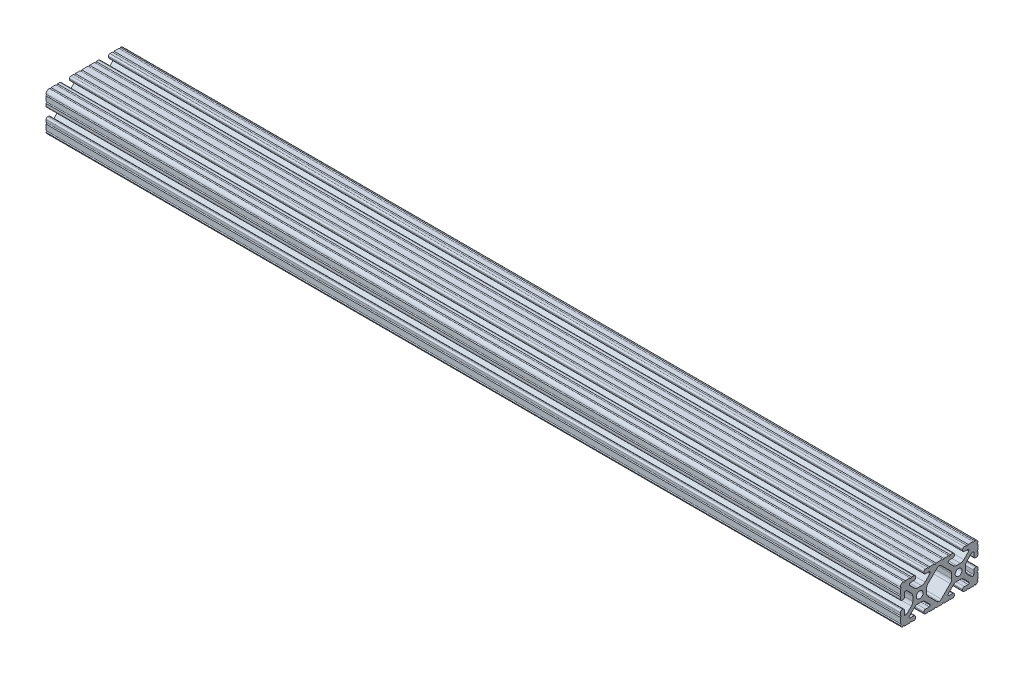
from build123d import *

# Parameters (mm, degrees)
SKETCH1_R      = 3.3274
EXTRUDE1_DEPTH = 838.2
SKETCH3_R      = 3.571875
EXTRUDE2_DEPTH = 38.1


with BuildPart() as part:
    # Sketch1 → Extrude1 (new body)
    with BuildSketch(Plane(origin=(0, 0, 0), x_dir=(0, 0, -1), z_dir=(1, 0, 0))):
        with BuildLine():
            Line((37.1900335, 54.320138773), (37.1900335, 54.882716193))
            ThreePointArc((37.1900335, 54.882716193), (37.450415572, 55.511334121), (38.0790335, 55.771716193))
            Line((38.0790335, 55.771716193), (41.685477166, 55.771716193))
            ThreePointArc((41.685477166, 55.771716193), (42.799028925, 56.232964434), (43.260277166, 57.346516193))
            Line((43.260277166, 57.346516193), (43.260277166, 58.282488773))
            ThreePointArc((43.260277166, 58.282488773), (42.805347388, 59.380786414), (41.707049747, 59.835716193))
            Line((41.707049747, 59.835716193), (39.271813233, 59.835716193))
            ThreePointArc((39.271813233, 59.835716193), (38.509813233, 59.073716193), (37.747813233, 59.835716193))
            Line((37.747813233, 59.835716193), (32.919398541, 59.835716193))
            ThreePointArc((32.919398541, 59.835716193), (32.157398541, 59.073716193), (31.395398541, 59.835716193))
            Line((31.395398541, 59.835716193), (25.153155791, 59.835716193))
            ThreePointArc((25.153155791, 59.835716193), (24.391155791, 59.073716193), (23.629155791, 59.835716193))
            Line((23.629155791, 59.835716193), (18.800741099, 59.835716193))
            ThreePointArc((18.800741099, 59.835716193), (18.038741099, 59.073716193), (17.276741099, 59.835716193))
            Line((17.276741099, 59.835716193), (14.841504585, 59.835716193))
            ThreePointArc((14.841504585, 59.835716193), (13.743206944, 59.380786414), (13.288277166, 58.282488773))
            Line((13.288277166, 58.282488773), (13.288277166, 57.346516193))
            ThreePointArc((13.288277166, 57.346516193), (13.749525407, 56.232964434), (14.863077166, 55.771716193))
            Line((14.863077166, 55.771716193), (18.469520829, 55.771716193))
            ThreePointArc((18.469520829, 55.771716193), (19.098138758, 55.511334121), (19.358520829, 54.882716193))
            Line((19.358520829, 54.882716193), (19.358520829, 54.320138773))
            ThreePointArc((19.358520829, 54.320138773), (19.290850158, 53.979934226), (19.098140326, 53.691522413))
            Line((19.098140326, 53.691522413), (14.421778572, 49.015137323))
            ThreePointArc((14.421778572, 49.015137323), (12.880829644, 47.985503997), (11.063154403, 47.623944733))
            Line((11.063154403, 47.623944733), (7.38539993, 47.623944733))
            ThreePointArc((7.38539993, 47.623944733), (5.567724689, 47.985503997), (4.026775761, 49.015137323))
            Line((4.026775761, 49.015137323), (-0.649585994, 53.691522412))
            ThreePointArc((-0.649585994, 53.691522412), (-0.842295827, 53.979934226), (-0.909966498, 54.320138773))
            Line((-0.909966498, 54.320138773), (-0.909966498, 54.882716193))
            ThreePointArc((-0.909966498, 54.882716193), (-0.649584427, 55.511334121), (-0.020966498, 55.771716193))
            Line((-0.020966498, 55.771716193), (3.585477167, 55.771716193))
            ThreePointArc((3.585477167, 55.771716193), (4.699028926, 56.232964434), (5.160277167, 57.346516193))
            Line((5.160277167, 57.346516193), (5.160277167, 58.266281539))
            ThreePointArc((5.160277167, 58.266281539), (4.744040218, 59.332924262), (3.715361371, 59.835716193))
            Line((3.715361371, 59.835716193), (1.328459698, 59.835716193))
            ThreePointArc((1.328459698, 59.835716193), (0.566459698, 59.073716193), (-0.195540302, 59.835716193))
            Line((-0.195540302, 59.835716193), (-5.021979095, 59.835716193))
            ThreePointArc((-5.021979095, 59.835716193), (-5.807035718, 59.097492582), (-6.545259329, 59.882549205))
            ThreePointArc((-6.545259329, 59.882549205), (-8.87374186, 58.977730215), (-9.863337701, 56.683993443))
            ThreePointArc((-9.863337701, 56.683993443), (-9.063955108, 55.941735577), (-9.825722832, 55.160922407))
            Line((-9.825722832, 55.160922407), (-9.825722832, 50.335417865))
            ThreePointArc((-9.825722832, 50.335417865), (-9.063722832, 49.573417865), (-9.825722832, 48.811417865))
            Line((-9.825722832, 48.811417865), (-9.825722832, 46.424516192))
            ThreePointArc((-9.825722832, 46.424516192), (-9.364474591, 45.310964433), (-8.250922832, 44.849716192))
            Line((-8.250922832, 44.849716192), (-7.336522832, 44.849716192))
            ThreePointArc((-7.336522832, 44.849716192), (-6.222971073, 45.310964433), (-5.761722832, 46.424516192))
            Line((-5.761722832, 46.424516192), (-5.761722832, 50.183716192))
            ThreePointArc((-5.761722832, 50.183716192), (-5.50134076, 50.81233412), (-4.872722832, 51.072716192))
            Line((-4.872722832, 51.072716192), (-4.146379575, 51.072716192))
            ThreePointArc((-4.146379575, 51.072716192), (-3.806172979, 51.005044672), (-3.517760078, 50.812332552))
            Line((-3.517760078, 50.812332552), (1.076701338, 46.217848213))
            ThreePointArc((1.076701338, 46.217848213), (2.10632244, 44.676905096), (2.467877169, 42.859240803))
            Line((2.467877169, 42.859240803), (2.467877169, 38.712191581))
            ThreePointArc((2.467877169, 38.712191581), (2.10632244, 36.894527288), (1.076701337, 35.353584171))
            Line((1.076701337, 35.353584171), (-3.517760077, 30.759099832))
            ThreePointArc((-3.517760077, 30.759099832), (-3.806172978, 30.566387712), (-4.146379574, 30.498716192))
            Line((-4.146379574, 30.498716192), (-4.872722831, 30.498716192))
            ThreePointArc((-4.872722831, 30.498716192), (-5.501340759, 30.759098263), (-5.761722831, 31.387716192))
            Line((-5.761722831, 31.387716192), (-5.761722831, 35.146916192))
            ThreePointArc((-5.761722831, 35.146916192), (-6.222971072, 36.260467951), (-7.336522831, 36.721716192))
            Line((-7.336522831, 36.721716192), (-8.250922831, 36.721716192))
            ThreePointArc((-8.250922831, 36.721716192), (-9.36447459, 36.260467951), (-9.825722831, 35.146916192))
            Line((-9.825722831, 35.146916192), (-9.825722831, 32.760014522))
            ThreePointArc((-9.825722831, 32.760014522), (-9.063722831, 31.998014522), (-9.825722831, 31.236014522))
            Line((-9.825722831, 31.236014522), (-9.825722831, 25.74969698))
            ThreePointArc((-9.825722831, 25.74969698), (-9.063722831, 24.98769698), (-9.825722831, 24.22569698))
            ThreePointArc((-9.825722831, 24.22569698), (-8.934545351, 22.601713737), (-7.296996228, 21.735716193))
            ThreePointArc((-7.296996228, 21.735716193), (-6.534996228, 22.497716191), (-5.77299623, 21.735716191))
            Line((-5.77299623, 21.735716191), (-0.195540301, 21.735716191))
            ThreePointArc((-0.195540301, 21.735716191), (0.566459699, 22.497716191), (1.328459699, 21.735716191))
            Line((1.328459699, 21.735716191), (3.585477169, 21.735716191))
            ThreePointArc((3.585477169, 21.735716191), (4.699028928, 22.196964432), (5.160277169, 23.310516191))
            Line((5.160277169, 23.310516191), (5.160277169, 24.224916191))
            ThreePointArc((5.160277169, 24.224916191), (4.699028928, 25.33846795), (3.585477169, 25.799716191))
            Line((3.585477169, 25.799716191), (-0.173722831, 25.799716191))
            ThreePointArc((-0.173722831, 25.799716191), (-0.80234076, 26.060098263), (-1.062722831, 26.688716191))
            Line((-1.062722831, 26.688716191), (-1.062722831, 27.098536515))
            ThreePointArc((-1.062722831, 27.098536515), (-0.99505216, 27.438741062), (-0.802342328, 27.727152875))
            Line((-0.802342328, 27.727152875), (4.026775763, 32.556295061))
            ThreePointArc((4.026775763, 32.556295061), (5.567724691, 33.585928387), (7.385399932, 33.947487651))
            Line((7.385399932, 33.947487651), (11.063154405, 33.947487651))
            ThreePointArc((11.063154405, 33.947487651), (12.880829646, 33.585928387), (14.421778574, 32.556295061))
            Line((14.421778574, 32.556295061), (19.250896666, 27.727152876))
            ThreePointArc((19.250896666, 27.727152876), (19.443606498, 27.438741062), (19.511277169, 27.098536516))
            Line((19.511277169, 27.098536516), (19.511277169, 26.688716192))
            ThreePointArc((19.511277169, 26.688716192), (19.250895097, 26.060098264), (18.622277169, 25.799716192))
            Line((18.622277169, 25.799716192), (14.863077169, 25.799716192))
            ThreePointArc((14.863077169, 25.799716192), (13.74952541, 25.338467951), (13.288277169, 24.224916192))
            Line((13.288277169, 24.224916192), (13.288277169, 23.310516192))
            ThreePointArc((13.288277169, 23.310516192), (13.74952541, 22.196964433), (14.863077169, 21.735716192))
            Line((14.863077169, 21.735716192), (17.276741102, 21.735716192))
            ThreePointArc((17.276741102, 21.735716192), (18.038741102, 22.497716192), (18.800741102, 21.735716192))
            Line((18.800741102, 21.735716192), (23.629155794, 21.735716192))
            ThreePointArc((23.629155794, 21.735716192), (24.391155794, 22.497716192), (25.153155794, 21.735716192))
            Line((25.153155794, 21.735716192), (31.395398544, 21.735716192))
            ThreePointArc((31.395398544, 21.735716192), (32.157398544, 22.497716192), (32.919398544, 21.735716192))
            Line((32.919398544, 21.735716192), (37.747813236, 21.735716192))
            ThreePointArc((37.747813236, 21.735716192), (38.509813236, 22.497716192), (39.271813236, 21.735716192))
            Line((39.271813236, 21.735716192), (41.685477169, 21.735716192))
            ThreePointArc((41.685477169, 21.735716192), (42.799028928, 22.196964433), (43.260277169, 23.310516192))
            Line((43.260277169, 23.310516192), (43.260277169, 24.224916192))
            ThreePointArc((43.260277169, 24.224916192), (42.799028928, 25.338467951), (41.685477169, 25.799716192))
            Line((41.685477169, 25.799716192), (37.926277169, 25.799716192))
            ThreePointArc((37.926277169, 25.799716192), (37.29765924, 26.060098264), (37.037277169, 26.688716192))
            Line((37.037277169, 26.688716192), (37.037277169, 27.098536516))
            ThreePointArc((37.037277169, 27.098536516), (37.10494784, 27.438741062), (37.297657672, 27.727152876))
            Line((37.297657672, 27.727152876), (42.126775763, 32.556295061))
            ThreePointArc((42.126775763, 32.556295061), (43.667724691, 33.585928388), (45.485399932, 33.947487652))
            Line((45.485399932, 33.947487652), (49.163154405, 33.947487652))
            ThreePointArc((49.163154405, 33.947487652), (50.980829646, 33.585928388), (52.521778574, 32.556295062))
            Line((52.521778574, 32.556295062), (57.350896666, 27.727152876))
            ThreePointArc((57.350896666, 27.727152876), (57.543606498, 27.438741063), (57.611277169, 27.098536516))
            Line((57.611277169, 27.098536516), (57.611277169, 26.688716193))
            ThreePointArc((57.611277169, 26.688716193), (57.350895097, 26.060098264), (56.722277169, 25.799716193))
            Line((56.722277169, 25.799716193), (52.963077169, 25.799716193))
            ThreePointArc((52.963077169, 25.799716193), (51.84952541, 25.338467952), (51.388277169, 24.224916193))
            Line((51.388277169, 24.224916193), (51.388277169, 23.310516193))
            ThreePointArc((51.388277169, 23.310516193), (51.84952541, 22.196964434), (52.963077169, 21.735716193))
            Line((52.963077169, 21.735716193), (55.220094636, 21.735716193))
            ThreePointArc((55.220094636, 21.735716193), (55.982094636, 22.497716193), (56.744094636, 21.735716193))
            Line((56.744094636, 21.735716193), (62.321550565, 21.735716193))
            ThreePointArc((62.321550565, 21.735716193), (63.083550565, 22.497716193), (63.845550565, 21.735716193))
            ThreePointArc((63.845550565, 21.735716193), (65.481854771, 22.602978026), (66.374277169, 24.225696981))
            ThreePointArc((66.374277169, 24.225696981), (65.612277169, 24.987696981), (66.374277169, 25.749696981))
            Line((66.374277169, 25.749696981), (66.374277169, 31.236014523))
            ThreePointArc((66.374277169, 31.236014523), (65.612277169, 31.998014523), (66.374277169, 32.760014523))
            Line((66.374277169, 32.760014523), (66.374277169, 35.146916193))
            ThreePointArc((66.374277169, 35.146916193), (65.913028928, 36.260467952), (64.799477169, 36.721716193))
            Line((64.799477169, 36.721716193), (63.885077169, 36.721716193))
            ThreePointArc((63.885077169, 36.721716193), (62.77152541, 36.260467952), (62.310277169, 35.146916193))
            Line((62.310277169, 35.146916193), (62.310277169, 31.387716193))
            ThreePointArc((62.310277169, 31.387716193), (62.049895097, 30.759098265), (61.421277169, 30.498716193))
            Line((61.421277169, 30.498716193), (60.694933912, 30.498716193))
            ThreePointArc((60.694933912, 30.498716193), (60.354727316, 30.566387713), (60.066314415, 30.759099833))
            Line((60.066314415, 30.759099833), (55.471853, 35.353584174))
            ThreePointArc((55.471853, 35.353584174), (54.442231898, 36.894527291), (54.08067717, 38.712191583))
            Line((54.08067717, 38.712191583), (54.08067717, 42.859240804))
            ThreePointArc((54.08067717, 42.859240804), (54.442231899, 44.676905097), (55.471853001, 46.217848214))
            Line((55.471853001, 46.217848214), (60.066314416, 50.812332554))
            ThreePointArc((60.066314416, 50.812332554), (60.354727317, 51.005044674), (60.694933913, 51.072716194))
            Line((60.694933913, 51.072716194), (61.42127717, 51.072716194))
            ThreePointArc((61.42127717, 51.072716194), (62.049895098, 50.812334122), (62.31027717, 50.183716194))
            Line((62.31027717, 50.183716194), (62.31027717, 46.424516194))
            ThreePointArc((62.31027717, 46.424516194), (62.771525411, 45.310964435), (63.88507717, 44.849716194))
            Line((63.88507717, 44.849716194), (64.79947717, 44.849716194))
            ThreePointArc((64.79947717, 44.849716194), (65.913028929, 45.310964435), (66.37427717, 46.424516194))
            Line((66.37427717, 46.424516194), (66.37427717, 48.811417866))
            ThreePointArc((66.37427717, 48.811417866), (65.61227717, 49.573417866), (66.37427717, 50.335417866))
            Line((66.37427717, 50.335417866), (66.37427717, 55.160922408))
            ThreePointArc((66.37427717, 55.160922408), (65.612509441, 55.941735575), (66.411892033, 56.683993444))
            ThreePointArc((66.411892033, 56.683993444), (65.422296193, 58.977730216), (63.093813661, 59.882549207))
            ThreePointArc((63.093813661, 59.882549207), (62.355590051, 59.097492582), (61.570533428, 59.835716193))
            Line((61.570533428, 59.835716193), (56.744094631, 59.835716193))
            ThreePointArc((56.744094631, 59.835716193), (55.982094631, 59.073716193), (55.220094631, 59.835716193))
            Line((55.220094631, 59.835716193), (52.833192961, 59.835716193))
            ThreePointArc((52.833192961, 59.835716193), (51.804514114, 59.332924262), (51.388277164, 58.266281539))
            Line((51.388277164, 58.266281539), (51.388277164, 57.346516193))
            ThreePointArc((51.388277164, 57.346516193), (51.849525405, 56.232964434), (52.963077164, 55.771716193))
            Line((52.963077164, 55.771716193), (56.569520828, 55.771716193))
            ThreePointArc((56.569520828, 55.771716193), (57.198138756, 55.511334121), (57.458520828, 54.882716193))
            Line((57.458520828, 54.882716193), (57.458520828, 54.320138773))
            ThreePointArc((57.458520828, 54.320138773), (57.390850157, 53.979934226), (57.198140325, 53.691522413))
            Line((57.198140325, 53.691522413), (52.52177857, 49.015137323))
            ThreePointArc((52.52177857, 49.015137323), (50.980829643, 47.985503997), (49.163154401, 47.623944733))
            Line((49.163154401, 47.623944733), (45.485399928, 47.623944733))
            ThreePointArc((45.485399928, 47.623944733), (43.667724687, 47.985503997), (42.12677576, 49.015137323))
            Line((42.12677576, 49.015137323), (37.450414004, 53.691522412))
            ThreePointArc((37.450414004, 53.691522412), (37.257704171, 53.979934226), (37.1900335, 54.320138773))
        make_face()
        with Locations((47.324277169, 40.785716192)):
            Circle(SKETCH1_R, mode=Mode.SUBTRACT)
        with Locations((9.224277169, 40.785716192)):
            Circle(SKETCH1_R, mode=Mode.SUBTRACT)
        with BuildLine():
            Line((30.35131253, 26.52815133), (39.176701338, 35.353584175))
            ThreePointArc((39.176701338, 35.353584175), (40.206322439, 36.894527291), (40.567877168, 38.712191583))
            Line((40.567877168, 38.712191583), (40.567877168, 42.859240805))
            ThreePointArc((40.567877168, 42.859240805), (40.206322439, 44.676905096), (39.176701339, 46.217848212))
            Line((39.176701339, 46.217848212), (30.35131253, 55.043281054))
            ThreePointArc((30.35131253, 55.043281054), (29.39832277, 55.678689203), (28.274277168, 55.898812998))
            ThreePointArc((28.274277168, 55.898812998), (27.150231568, 55.678689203), (26.197241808, 55.043281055))
            Line((26.197241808, 55.043281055), (17.371853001, 46.217848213))
            ThreePointArc((17.371853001, 46.217848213), (16.342231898, 44.676905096), (15.980677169, 42.859240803))
            Line((15.980677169, 42.859240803), (15.980677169, 38.712191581))
            ThreePointArc((15.980677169, 38.712191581), (16.342231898, 36.894527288), (17.371853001, 35.353584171))
            Line((17.371853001, 35.353584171), (26.197241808, 26.528151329))
            ThreePointArc((26.197241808, 26.528151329), (27.150231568, 25.892743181), (28.274277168, 25.672619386))
            ThreePointArc((28.274277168, 25.672619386), (29.39832277, 25.892743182), (30.35131253, 26.52815133))
        make_face(mode=Mode.SUBTRACT)
    extrude(amount=EXTRUDE1_DEPTH)

    # Sketch3 → Extrude2 (cut)
    with BuildSketch(Plane.XZ.offset(-21.735716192)):
        with Locations(Location((19.05, -9.224277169, 0), (0, 0, 210.985509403))):
            Circle(SKETCH3_R)
        with Locations(Location((19.05, -47.324277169, 0), (0, 0, 210.985509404))):
            Circle(SKETCH3_R)
        with Locations(Location((819.15, -9.224277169, 0), (0, 0, 210.985509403))):
            Circle(SKETCH3_R)
        with Locations(Location((819.15, -47.32427717, 0), (0, 0, 210.985509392))):
            Circle(SKETCH3_R)
    extrude(amount=-EXTRUDE2_DEPTH, mode=Mode.SUBTRACT)


solid = part.part
